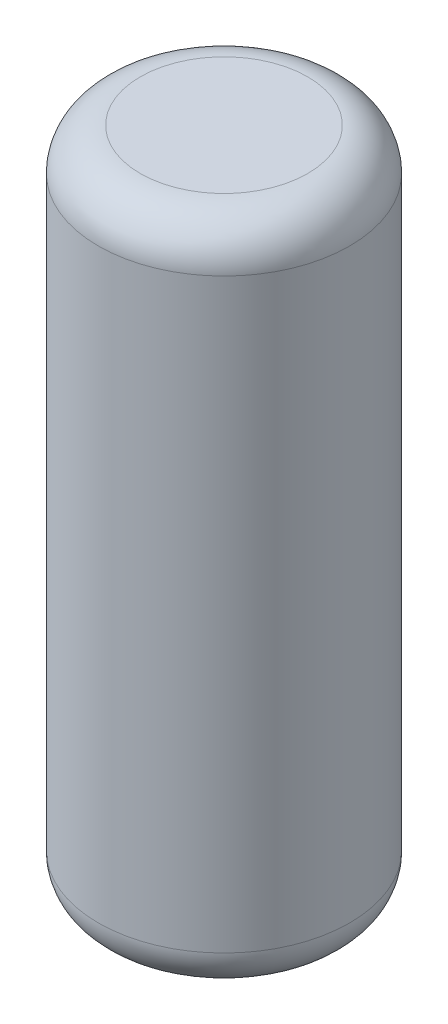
ISO-10303-21;
HEADER;
FILE_DESCRIPTION(('STEP AP214'),'2;1');
FILE_NAME('part.step','',(''),(''),'','','');
FILE_SCHEMA(('AUTOMOTIVE_DESIGN { 1 0 10303 214 1 1 1 1 }'));
ENDSEC;
DATA;
#1=APPLICATION_CONTEXT('core data for automotive mechanical design processes');
#2=APPLICATION_PROTOCOL_DEFINITION('international standard','automotive_design',2000,#1);
#3=PRODUCT_CONTEXT('',#1,'mechanical');
#4=PRODUCT('Part','Part','',(#3));
#5=PRODUCT_RELATED_PRODUCT_CATEGORY('part','',(#4));
#6=PRODUCT_DEFINITION_FORMATION('','',#4);
#7=PRODUCT_DEFINITION_CONTEXT('part definition',#1,'design');
#8=PRODUCT_DEFINITION('design','',#6,#7);
#9=PRODUCT_DEFINITION_SHAPE('','',#8);
#10=(LENGTH_UNIT() NAMED_UNIT(*) SI_UNIT(.MILLI.,.METRE.));
#11=(NAMED_UNIT(*) PLANE_ANGLE_UNIT() SI_UNIT($,.RADIAN.));
#12=(NAMED_UNIT(*) SI_UNIT($,.STERADIAN.) SOLID_ANGLE_UNIT());
#13=UNCERTAINTY_MEASURE_WITH_UNIT(LENGTH_MEASURE(1.E-05),#10,'distance_accuracy_value','');
#14=(GEOMETRIC_REPRESENTATION_CONTEXT(3) GLOBAL_UNCERTAINTY_ASSIGNED_CONTEXT((#13)) GLOBAL_UNIT_ASSIGNED_CONTEXT((#10,
#11,#12)) REPRESENTATION_CONTEXT('',''));
#15=CARTESIAN_POINT('',(0.,0.,0.));
#16=DIRECTION('',(0.,0.,1.));
#17=DIRECTION('',(1.,0.,0.));
#18=AXIS2_PLACEMENT_3D('',#15,#16,#17);
#19=CARTESIAN_POINT('',(0.,8.,0.));
#20=DIRECTION('',(0.,-1.,0.));
#21=DIRECTION('',(0.,0.,-1.));
#22=AXIS2_PLACEMENT_3D('',#19,#20,#21);
#23=CYLINDRICAL_SURFACE('',#22,1.5);
#24=CARTESIAN_POINT('',(0.,0.5,0.));
#25=DIRECTION('',(0.,1.,0.));
#26=DIRECTION('',(0.,0.,1.));
#27=AXIS2_PLACEMENT_3D('',#24,#25,#26);
#28=CIRCLE('',#27,1.5);
#29=CARTESIAN_POINT('',(0.,0.5,1.5));
#30=VERTEX_POINT('',#29);
#31=EDGE_CURVE('E62',#30,#30,#28,.T.);
#32=ORIENTED_EDGE('',*,*,#31,.T.);
#33=EDGE_LOOP('',(#32));
#34=FACE_BOUND('',#33,.T.);
#35=CARTESIAN_POINT('',(0.,7.5,0.));
#36=DIRECTION('',(0.,1.,0.));
#37=DIRECTION('',(0.,0.,1.));
#38=AXIS2_PLACEMENT_3D('',#35,#36,#37);
#39=CIRCLE('',#38,1.5);
#40=CARTESIAN_POINT('',(0.,7.5,1.5));
#41=VERTEX_POINT('',#40);
#42=EDGE_CURVE('E67',#41,#41,#39,.F.);
#43=ORIENTED_EDGE('',*,*,#42,.T.);
#44=EDGE_LOOP('',(#43));
#45=FACE_BOUND('',#44,.T.);
#46=ADVANCED_FACE('F49',(#34,#45),#23,.T.);
#47=CARTESIAN_POINT('',(0.,8.,0.));
#48=DIRECTION('',(0.,1.,0.));
#49=DIRECTION('',(0.,0.,1.));
#50=AXIS2_PLACEMENT_3D('',#47,#48,#49);
#51=PLANE('',#50);
#52=CARTESIAN_POINT('',(0.,8.,0.));
#53=DIRECTION('',(0.,1.,0.));
#54=DIRECTION('',(0.,0.,1.));
#55=AXIS2_PLACEMENT_3D('',#52,#53,#54);
#56=CIRCLE('',#55,1.);
#57=CARTESIAN_POINT('',(0.,8.,1.));
#58=VERTEX_POINT('',#57);
#59=EDGE_CURVE('E10',#58,#58,#56,.T.);
#60=ORIENTED_EDGE('',*,*,#59,.T.);
#61=EDGE_LOOP('',(#60));
#62=FACE_BOUND('',#61,.T.);
#63=ADVANCED_FACE('F84',(#62),#51,.T.);
#64=CARTESIAN_POINT('',(0.,0.,0.));
#65=DIRECTION('',(0.,1.,0.));
#66=DIRECTION('',(0.,0.,1.));
#67=AXIS2_PLACEMENT_3D('',#64,#65,#66);
#68=PLANE('',#67);
#69=CARTESIAN_POINT('',(0.,0.,0.));
#70=DIRECTION('',(0.,1.,0.));
#71=DIRECTION('',(0.,0.,1.));
#72=AXIS2_PLACEMENT_3D('',#69,#70,#71);
#73=CIRCLE('',#72,1.);
#74=CARTESIAN_POINT('',(0.,0.,1.));
#75=VERTEX_POINT('',#74);
#76=EDGE_CURVE('E57',#75,#75,#73,.F.);
#77=ORIENTED_EDGE('',*,*,#76,.T.);
#78=EDGE_LOOP('',(#77));
#79=FACE_BOUND('',#78,.T.);
#80=ADVANCED_FACE('F81',(#79),#68,.F.);
#81=CARTESIAN_POINT('',(0.,0.5,0.));
#82=DIRECTION('',(0.,1.,0.));
#83=DIRECTION('',(0.,0.,1.));
#84=AXIS2_PLACEMENT_3D('',#81,#82,#83);
#85=TOROIDAL_SURFACE('',#84,1.,0.5);
#86=ORIENTED_EDGE('',*,*,#76,.F.);
#87=EDGE_LOOP('',(#86));
#88=FACE_BOUND('',#87,.T.);
#89=ORIENTED_EDGE('',*,*,#31,.F.);
#90=EDGE_LOOP('',(#89));
#91=FACE_BOUND('',#90,.T.);
#92=ADVANCED_FACE('F77',(#88,#91),#85,.T.);
#93=CARTESIAN_POINT('',(0.,7.5,0.));
#94=DIRECTION('',(0.,1.,0.));
#95=DIRECTION('',(0.,0.,1.));
#96=AXIS2_PLACEMENT_3D('',#93,#94,#95);
#97=TOROIDAL_SURFACE('',#96,1.,0.5);
#98=ORIENTED_EDGE('',*,*,#42,.F.);
#99=EDGE_LOOP('',(#98));
#100=FACE_BOUND('',#99,.T.);
#101=ORIENTED_EDGE('',*,*,#59,.F.);
#102=EDGE_LOOP('',(#101));
#103=FACE_BOUND('',#102,.T.);
#104=ADVANCED_FACE('F51',(#100,#103),#97,.T.);
#105=CLOSED_SHELL('',(#46,#63,#80,#92,#104));
#106=MANIFOLD_SOLID_BREP('B2',#105);
#107=ADVANCED_BREP_SHAPE_REPRESENTATION('',(#18,#106),#14);
#108=SHAPE_DEFINITION_REPRESENTATION(#9,#107);
ENDSEC;
END-ISO-10303-21;
